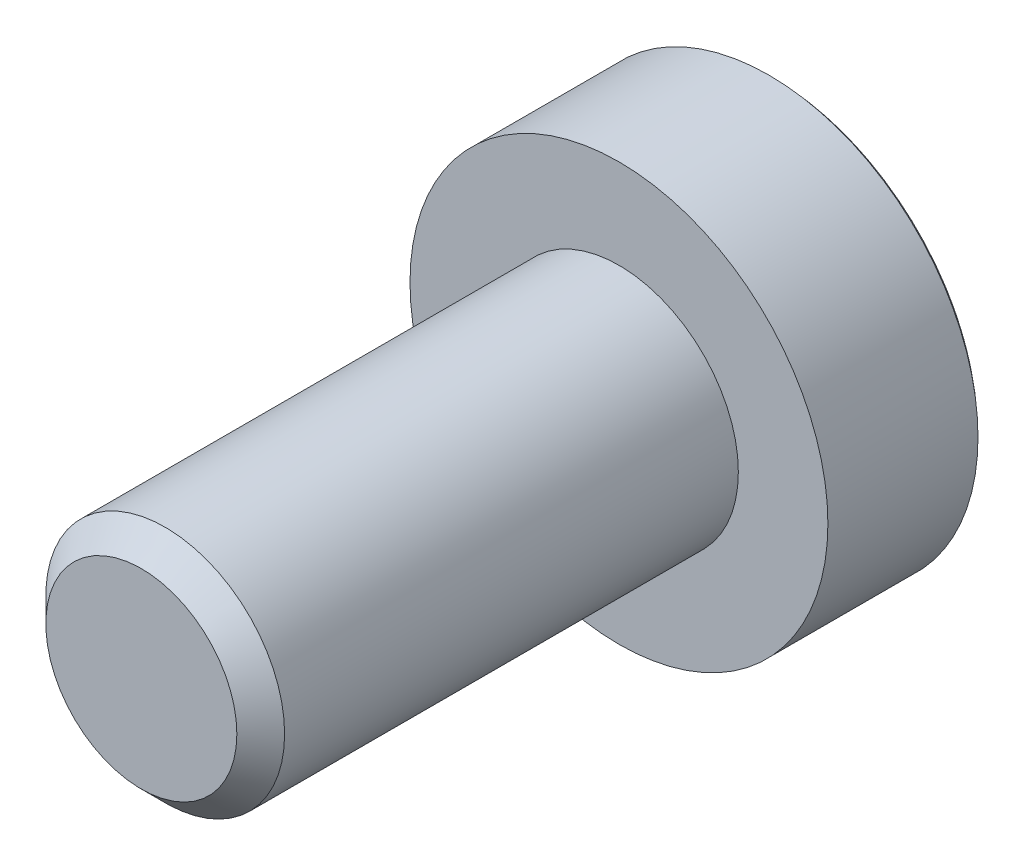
from build123d import *

# Parameters (mm, degrees)
SKETCH1_R           = 1.9
BASE_EXTRUDE_DEPTH  = 1.4
SKETCH2_R           = 1
BOSS_EXTRUDE1_DEPTH = 4
CHAMFER1_SIZE       = 0.2
CHAMFER2_SIZE       = 0.1
FILLET1_R           = 0.5
CUT_EXTRUDE1_DEPTH  = 0.5
CUT_EXTRUDE1_DRAFT  = -10
SKETCH4_OUTSIDE_W   = 7.324
SKETCH4_OUTSIDE_H   = 7.324
SKETCH4_OUTSIDE_R   = 1.75
EXTRUDE1_DEPTH      = 6


with BuildPart() as part:
    # Sketch1 → Base-Extrude (new body)
    with BuildSketch(Plane.XY):
        Circle(SKETCH1_R)
    extrude(amount=BASE_EXTRUDE_DEPTH)

    # Sketch2 → Boss-Extrude1 (add)
    with BuildSketch(Plane.XY.offset(1.4)):
        Circle(SKETCH2_R)
    extrude(amount=BOSS_EXTRUDE1_DEPTH)

    # Chamfer1
    chamfer1_edges = [part.edges().sort_by_distance(p)[0] for p in [
        (-1, 0, 5.4),
    ]]
    chamfer(chamfer1_edges, length=CHAMFER1_SIZE)

    # Chamfer2
    chamfer2_edges = [part.edges().sort_by_distance(p)[0] for p in [
        (-1.9, 0, 1.4),
    ]]
    chamfer(chamfer2_edges, length=CHAMFER2_SIZE)

    # Fillet1
    fillet1_edges = [part.edges().sort_by_distance(p)[0] for p in [
        (-1.9, 0, 0),
    ]]
    fillet(fillet1_edges, radius=FILLET1_R)


with BuildPart() as cut_extrude1_tool:
    # Sketch3 → Cut-Extrude1 (with draft: the straight prism first)
    with BuildSketch(Plane(origin=(0, 0, 0), x_dir=(-1, 0, 0), z_dir=(0, 0, -1))):
        with BuildLine():
            Line((-0.3, 1.288563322), (-0.3, 0.292443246))
            Line((-0.3, 0.292443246), (-1.290299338, 0.292443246))
            ThreePointArc((-1.290299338, 0.292443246), (-1.323019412, -0.003881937), (-1.288560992, -0.300010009))
            Line((-1.288560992, -0.300010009), (-0.3, -0.300010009))
            Line((-0.3, -0.300010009), (-0.3, -1.288563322))
            ThreePointArc((-0.3, -1.288563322), (0, -1.323025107), (0.3, -1.288563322))
            Line((0.3, -1.288563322), (0.3, -0.300010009))
            Line((0.3, -0.300010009), (1.288560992, -0.300010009))
            ThreePointArc((1.288560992, -0.300010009), (1.323019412, -0.003881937), (1.290299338, 0.292443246))
            Line((1.290299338, 0.292443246), (0.3, 0.292443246))
            Line((0.3, 0.292443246), (0.3, 1.288563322))
            ThreePointArc((0.3, 1.288563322), (0, 1.323025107), (-0.3, 1.288563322))
        make_face()
    extrude(amount=-CUT_EXTRUDE1_DEPTH)
    # Cut-Extrude1: the draft: its side faces are tilted about the plane it starts from
    cut_extrude1_sides = [cut_extrude1_tool.faces().sort_by_distance(p)[0] for p in [
        (0, 1.323025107, 0.25),
        (0.3, 0.790503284, 0.25),
        (0.795149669, 0.292443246, 0.25),
        (1.323019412, -0.003881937, 0.25),
        (0.794280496, -0.300010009, 0.25),
        (0.3, -0.794286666, 0.25),
        (0, -1.323025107, 0.25),
        (-0.3, -0.794286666, 0.25),
        (-0.794280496, -0.300010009, 0.25),
        (-1.323019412, -0.003881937, 0.25),
        (-0.795149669, 0.292443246, 0.25),
        (-0.3, 0.790503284, 0.25),
    ]]
    draft(cut_extrude1_sides, Plane(origin=(0, 0, 0), x_dir=(-1, 0, 0), z_dir=(0, 0, -1)), CUT_EXTRUDE1_DRAFT)


with BuildPart() as part_1:
    add(part.part)

    # Cut-Extrude1: cut by cut_extrude1_tool
    add(cut_extrude1_tool.part, mode=Mode.SUBTRACT)

    # Sketch4 outside → Extrude1 (cut)
    with BuildSketch(Plane(origin=(0, 0, 0), x_dir=(-1, 0, 0), z_dir=(0, 0, -1))):
        Rectangle(SKETCH4_OUTSIDE_W, SKETCH4_OUTSIDE_H)
        with Locations(Location((0, 0, 0), (0, 0, 180))):
            Circle(SKETCH4_OUTSIDE_R, mode=Mode.SUBTRACT)
    extrude(amount=-EXTRUDE1_DEPTH, mode=Mode.SUBTRACT)


solid = part_1.part
